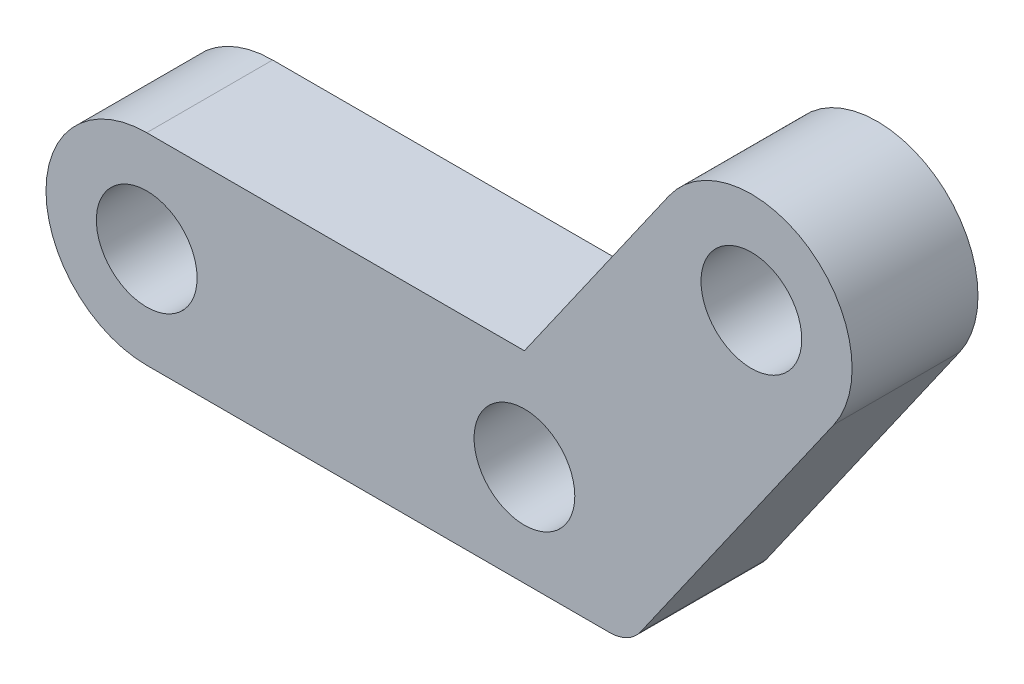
from build123d import *

# Parameters (mm, degrees)
SKETCH1_R          = 10.16
SKETCH1_R_2        = 10.160000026
BASE_EXTRUDE_DEPTH = 25.4


with BuildPart() as part:
    # Sketch1 → Base-Extrude (new body)
    with BuildSketch(Plane.XY):
        with BuildLine():
            Line((0, 0), (76.2, 0))
            Line((76.2, 0), (93.389124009, 0))
            ThreePointArc((93.389124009, 0), (96.907648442, 0.860977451), (99.631062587, 3.249347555))
            Line((99.631062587, 3.249347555), (109.49033908, 17.329853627))
            Line((109.49033908, 17.329853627), (138.628022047, 58.942777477))
            ThreePointArc((138.628022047, 58.942777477), (133.637925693, 87.243020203), (105.337682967, 82.25292385))
            Line((105.337682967, 82.25292385), (76.2, 40.64))
            Line((76.2, 40.64), (0, 40.64))
            ThreePointArc((0, 40.64), (-20.32, 20.32), (0, 0))
        make_face()
        with Locations((0, 20.32)):
            Circle(SKETCH1_R, mode=Mode.SUBTRACT)
        with Locations((121.982852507, 70.597850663)):
            Circle(SKETCH1_R_2, mode=Mode.SUBTRACT)
        with Locations((76.2, 20.32)):
            Circle(SKETCH1_R, mode=Mode.SUBTRACT)
    extrude(amount=BASE_EXTRUDE_DEPTH)


solid = part.part
